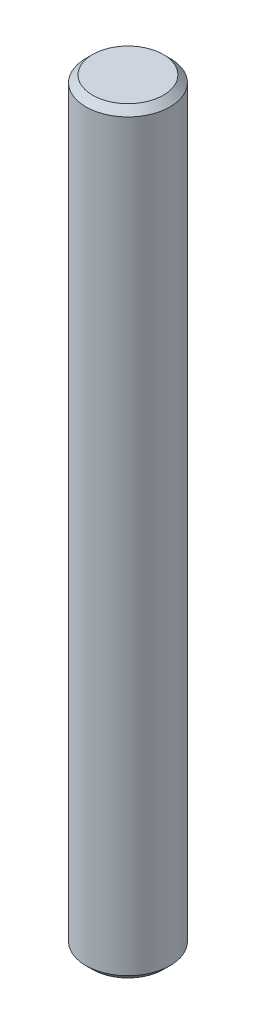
from build123d import *

# Parameters (mm, degrees)
SKETCH1_R      = 1.5875
EXTRUDE1_DEPTH = 14.2875
CHAMFER1_SIZE  = 0.254


with BuildPart() as part:
    # Sketch1 → Extrude1 (new, symmetric)
    with BuildSketch(Plane(origin=(0, 0, 0), x_dir=(1, 0, 0), z_dir=(0, 1, 0))):
        with Locations(Location((0, 0, 0), (0, 0, 270))):
            Circle(SKETCH1_R)
    extrude(amount=EXTRUDE1_DEPTH, both=True)

    # Chamfer1
    chamfer1_edges = [part.edges().sort_by_distance(p)[0] for p in [
        (0, -14.2875, -1.5875),
        (0, 14.2875, -1.5875),
    ]]
    chamfer(chamfer1_edges, length=CHAMFER1_SIZE)


solid = part.part
